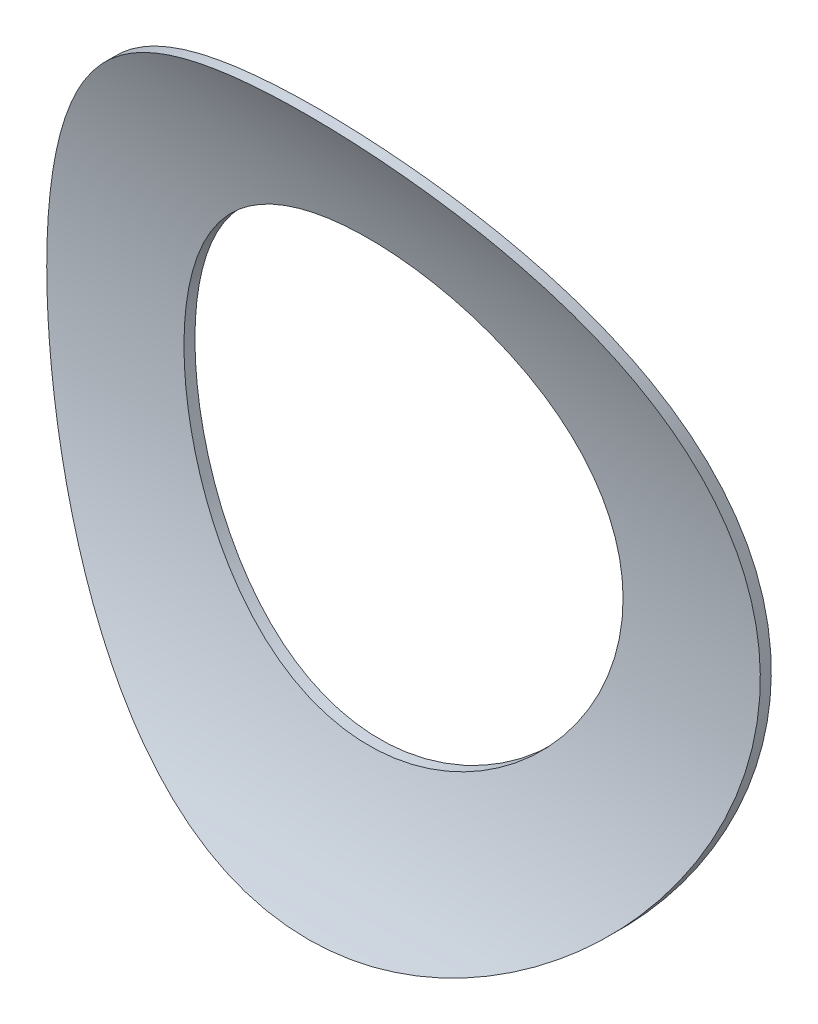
from build123d import *

# Parameters (mm, degrees)
ESQUISSE1_R                  = 6.5
ESQUISSE1_R_2                = 4
BASE_EXTRUSION_DEPTH         = 2
ENL_V_MAT_EXTRU_1_DEPTH      = 20
ENL_V_MAT_EXTRU_1_DEPTH_BACK = 10.407443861


with BuildPart() as part:
    # Esquisse1 → Base-Extrusion (new body)
    with BuildSketch(Plane.XY):
        with Locations(Location((0, 0, 0), (0, 0, 180))):
            Circle(ESQUISSE1_R)
        with Locations(Location((0, 0, 0), (0, 0, 180))):
            Circle(ESQUISSE1_R_2, mode=Mode.SUBTRACT)
    extrude(amount=BASE_EXTRUSION_DEPTH)

    # Esquisse3 → Enl_v. mat.-Extru.1 (cut, two sides: drawn at the far end of the back side and taken through both)
    with BuildSketch(Plane(origin=(0, 0, 0), x_dir=(0, 0, -1), z_dir=(1, 0, 0)).offset(-ENL_V_MAT_EXTRU_1_DEPTH_BACK)):
        with BuildLine():
            Line((-2.761955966, 8.011395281), (3.041843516, 8.011395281))
            Line((3.041843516, 8.011395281), (3.041843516, -8.043169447))
            Line((3.041843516, -8.043169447), (-2.786899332, -8.043169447))
            ThreePointArc((-2.786899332, -8.043169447), (-1.569e-05, -0.020197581), (-2.761955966, 8.011395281))
        make_face()
        with BuildLine():
            Line((-4.372669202, 8.011395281), (-2.961955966, 8.011395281))
            ThreePointArc((-2.961955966, 8.011395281), (-0.20001569, -0.020197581), (-2.986899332, -8.043169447))
            Line((-2.986899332, -8.043169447), (-4.372669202, -8.043169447))
            Line((-4.372669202, -8.043169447), (-4.372669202, 8.011395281))
        make_face()
    extrude(amount=ENL_V_MAT_EXTRU_1_DEPTH + ENL_V_MAT_EXTRU_1_DEPTH_BACK, mode=Mode.SUBTRACT)


solid = part.part
